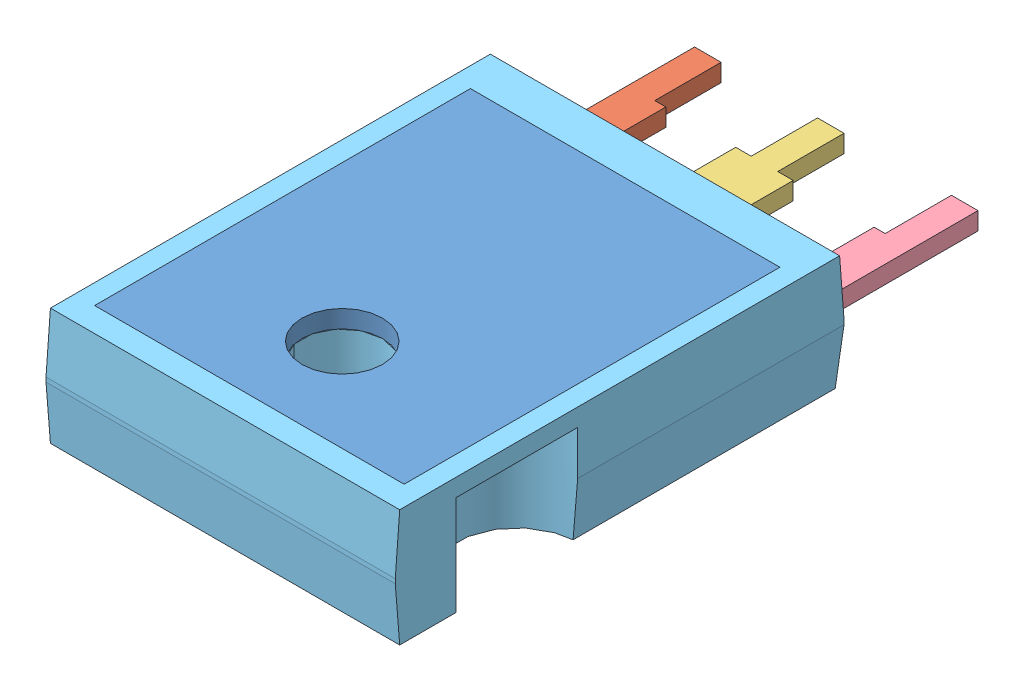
SolidWorks assembly User Library-TO-247AC.sldasm, configuration Default (file format 11000). Lengths in mm.
Overall size (15.8 5.3 27.6).
5 component instances, 5 part files, 0 mates.
Components (placement in the parent):
- User Library-TO-247AC_plate_cuted-1: User Library-TO-247AC_plate_cuted.sldprt [Default] at origin size (14 0.8 17)
- User Library-TO-247AC_pino1-1: User Library-TO-247AC_pino1.sldprt [Default] at origin size (1.7 0.8 7.3)
- User Library-TO-247AC_pino2-1: User Library-TO-247AC_pino2.sldprt [Default] at origin size (2.6 0.8 7.3)
- User Library-TO-247AC_pino3-1: User Library-TO-247AC_pino3.sldprt [Default] at origin size (1.7 0.8 7.3)
- User Library-TO-247AC_body_finished-1: User Library-TO-247AC_body_finished.sldprt [Default] at origin size (15.8 5.3 20.3)
